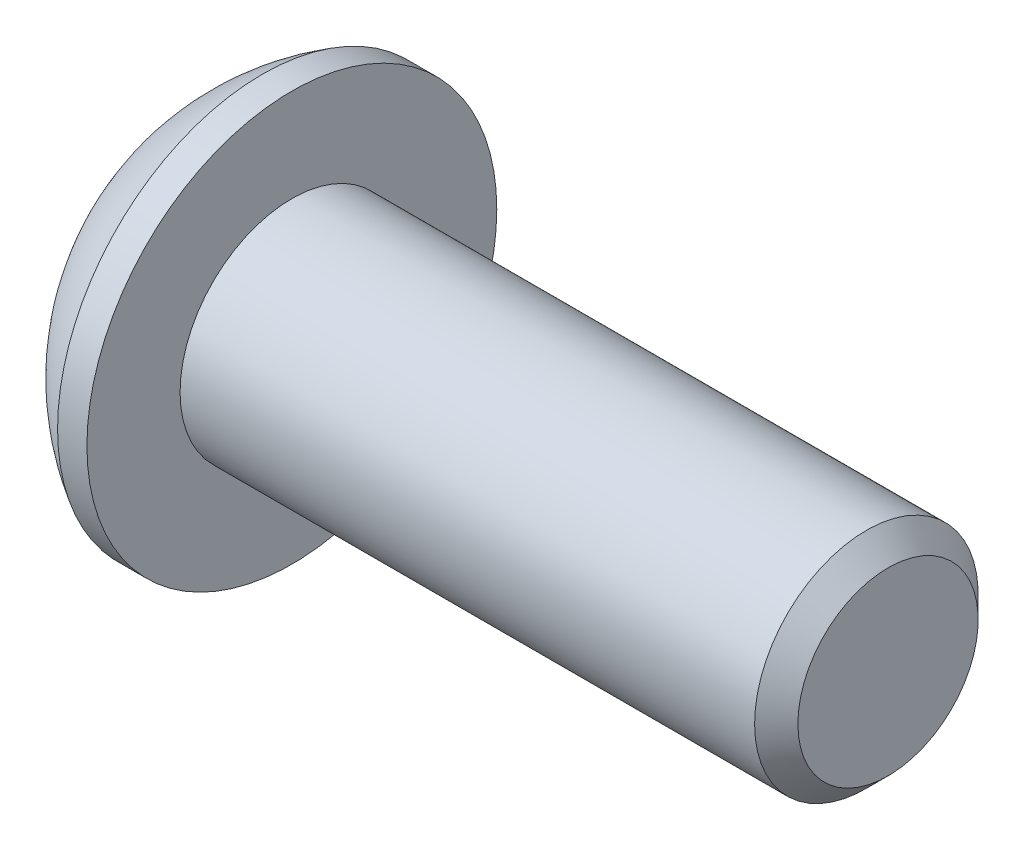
ISO-10303-21;
HEADER;
FILE_DESCRIPTION(('STEP AP214'),'2;1');
FILE_NAME('part.step','',(''),(''),'','','');
FILE_SCHEMA(('AUTOMOTIVE_DESIGN { 1 0 10303 214 1 1 1 1 }'));
ENDSEC;
DATA;
#1=APPLICATION_CONTEXT('core data for automotive mechanical design processes');
#2=APPLICATION_PROTOCOL_DEFINITION('international standard','automotive_design',2000,#1);
#3=PRODUCT_CONTEXT('',#1,'mechanical');
#4=PRODUCT('Part','Part','',(#3));
#5=PRODUCT_RELATED_PRODUCT_CATEGORY('part','',(#4));
#6=PRODUCT_DEFINITION_FORMATION('','',#4);
#7=PRODUCT_DEFINITION_CONTEXT('part definition',#1,'design');
#8=PRODUCT_DEFINITION('design','',#6,#7);
#9=PRODUCT_DEFINITION_SHAPE('','',#8);
#10=(LENGTH_UNIT() NAMED_UNIT(*) SI_UNIT(.MILLI.,.METRE.));
#11=(NAMED_UNIT(*) PLANE_ANGLE_UNIT() SI_UNIT($,.RADIAN.));
#12=(NAMED_UNIT(*) SI_UNIT($,.STERADIAN.) SOLID_ANGLE_UNIT());
#13=UNCERTAINTY_MEASURE_WITH_UNIT(LENGTH_MEASURE(1.E-05),#10,'distance_accuracy_value','');
#14=(GEOMETRIC_REPRESENTATION_CONTEXT(3) GLOBAL_UNCERTAINTY_ASSIGNED_CONTEXT((#13)) GLOBAL_UNIT_ASSIGNED_CONTEXT((#10,
#11,#12)) REPRESENTATION_CONTEXT('',''));
#15=CARTESIAN_POINT('',(0.,0.,0.));
#16=DIRECTION('',(0.,0.,1.));
#17=DIRECTION('',(1.,0.,0.));
#18=AXIS2_PLACEMENT_3D('',#15,#16,#17);
#19=CARTESIAN_POINT('',(0.,0.,0.));
#20=DIRECTION('',(-1.,0.,0.));
#21=DIRECTION('',(0.,0.,1.));
#22=AXIS2_PLACEMENT_3D('',#19,#20,#21);
#23=PLANE('',#22);
#24=CARTESIAN_POINT('',(0.,0.,0.));
#25=DIRECTION('',(-1.,0.,0.));
#26=DIRECTION('',(0.,0.,1.));
#27=AXIS2_PLACEMENT_3D('',#24,#25,#26);
#28=CIRCLE('',#27,2.75);
#29=CARTESIAN_POINT('',(0.,2.75,0.));
#30=VERTEX_POINT('',#29);
#31=EDGE_CURVE('E11',#30,#30,#28,.T.);
#32=ORIENTED_EDGE('',*,*,#31,.T.);
#33=EDGE_LOOP('',(#32));
#34=FACE_BOUND('',#33,.T.);
#35=DIRECTION('',(0.,-1.,0.));
#36=VECTOR('',#35,1.);
#37=CARTESIAN_POINT('',(0.,-1.15470053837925,2.));
#38=LINE('',#37,#36);
#39=CARTESIAN_POINT('',(0.,1.15470053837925,2.));
#40=VERTEX_POINT('',#39);
#41=CARTESIAN_POINT('',(0.,-1.15470053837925,2.));
#42=VERTEX_POINT('',#41);
#43=EDGE_CURVE('E111',#40,#42,#38,.T.);
#44=ORIENTED_EDGE('',*,*,#43,.T.);
#45=DIRECTION('',(0.,-0.5,-0.866025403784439));
#46=VECTOR('',#45,1.);
#47=CARTESIAN_POINT('',(0.,-2.3094010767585,0.));
#48=LINE('',#47,#46);
#49=CARTESIAN_POINT('',(0.,-2.3094010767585,0.));
#50=VERTEX_POINT('',#49);
#51=EDGE_CURVE('E52',#42,#50,#48,.T.);
#52=ORIENTED_EDGE('',*,*,#51,.T.);
#53=DIRECTION('',(0.,0.5,-0.866025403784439));
#54=VECTOR('',#53,1.);
#55=CARTESIAN_POINT('',(0.,-1.15470053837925,-2.));
#56=LINE('',#55,#54);
#57=CARTESIAN_POINT('',(0.,-1.15470053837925,-2.));
#58=VERTEX_POINT('',#57);
#59=EDGE_CURVE('E92',#50,#58,#56,.T.);
#60=ORIENTED_EDGE('',*,*,#59,.T.);
#61=DIRECTION('',(0.,1.,0.));
#62=VECTOR('',#61,1.);
#63=CARTESIAN_POINT('',(0.,1.15470053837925,-2.));
#64=LINE('',#63,#62);
#65=CARTESIAN_POINT('',(0.,1.15470053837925,-2.));
#66=VERTEX_POINT('',#65);
#67=EDGE_CURVE('E100',#58,#66,#64,.T.);
#68=ORIENTED_EDGE('',*,*,#67,.T.);
#69=DIRECTION('',(0.,0.5,0.866025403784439));
#70=VECTOR('',#69,1.);
#71=CARTESIAN_POINT('',(0.,2.3094010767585,0.));
#72=LINE('',#71,#70);
#73=CARTESIAN_POINT('',(0.,2.3094010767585,0.));
#74=VERTEX_POINT('',#73);
#75=EDGE_CURVE('E115',#66,#74,#72,.T.);
#76=ORIENTED_EDGE('',*,*,#75,.T.);
#77=DIRECTION('',(0.,-0.5,0.866025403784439));
#78=VECTOR('',#77,1.);
#79=CARTESIAN_POINT('',(0.,1.15470053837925,2.));
#80=LINE('',#79,#78);
#81=EDGE_CURVE('E118',#74,#40,#80,.T.);
#82=ORIENTED_EDGE('',*,*,#81,.T.);
#83=EDGE_LOOP('',(#44,#52,#60,#68,#76,#82));
#84=FACE_BOUND('',#83,.T.);
#85=ADVANCED_FACE('F38',(#34,#84),#23,.T.);
#86=CARTESIAN_POINT('',(5.7045250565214,0.,0.));
#87=DIRECTION('',(-1.,0.,0.));
#88=DIRECTION('',(0.,1.,0.));
#89=AXIS2_PLACEMENT_3D('',#86,#87,#88);
#90=SPHERICAL_SURFACE('',#89,6.33278028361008);
#91=CARTESIAN_POINT('',(2.5654,0.,0.));
#92=DIRECTION('',(-1.,0.,0.));
#93=DIRECTION('',(0.,0.,1.));
#94=AXIS2_PLACEMENT_3D('',#91,#92,#93);
#95=CIRCLE('',#94,5.5);
#96=CARTESIAN_POINT('',(2.5654,5.5,0.));
#97=VERTEX_POINT('',#96);
#98=EDGE_CURVE('E45',#97,#97,#95,.T.);
#99=CARTESIAN_POINT('',(2.5654,5.5,0.));
#100=CARTESIAN_POINT('',(2.53085550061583,5.48028378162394,0.));
#101=CARTESIAN_POINT('',(2.4964968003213,5.46024203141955,0.));
#102=CARTESIAN_POINT('',(2.42816308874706,5.41951476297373,0.));
#103=CARTESIAN_POINT('',(2.39418807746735,5.3988292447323,0.));
#104=CARTESIAN_POINT('',(2.32663383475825,5.35682173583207,0.));
#105=CARTESIAN_POINT('',(2.29305460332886,5.33549974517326,0.));
#106=CARTESIAN_POINT('',(2.22630383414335,5.29222687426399,0.));
#107=CARTESIAN_POINT('',(2.19313229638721,5.27027599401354,0.));
#108=CARTESIAN_POINT('',(2.12720869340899,5.22575313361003,0.));
#109=CARTESIAN_POINT('',(2.09445662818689,5.20318115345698,0.));
#110=CARTESIAN_POINT('',(2.02938359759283,5.15742410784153,0.));
#111=CARTESIAN_POINT('',(1.99706263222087,5.13423904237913,0.));
#112=CARTESIAN_POINT('',(1.93286327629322,5.08726405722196,0.));
#113=CARTESIAN_POINT('',(1.90098488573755,5.0634741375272,0.));
#114=CARTESIAN_POINT('',(1.83768199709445,5.01529789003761,0.));
#115=CARTESIAN_POINT('',(1.80625749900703,4.99091156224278,0.));
#116=CARTESIAN_POINT('',(1.74387355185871,4.94155115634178,0.));
#117=CARTESIAN_POINT('',(1.71291410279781,4.91657707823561,0.));
#118=CARTESIAN_POINT('',(1.6514712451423,4.8660500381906,0.));
#119=CARTESIAN_POINT('',(1.62098783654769,4.84049707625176,0.));
#120=CARTESIAN_POINT('',(1.56050788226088,4.78882134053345,0.));
#121=CARTESIAN_POINT('',(1.53051133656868,4.76269856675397,0.));
#122=CARTESIAN_POINT('',(1.47101575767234,4.70989248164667,0.));
#123=CARTESIAN_POINT('',(1.4415167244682,4.68320917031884,0.));
#124=CARTESIAN_POINT('',(1.38302664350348,4.6292914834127,0.));
#125=CARTESIAN_POINT('',(1.35403559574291,4.60205710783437,0.));
#126=CARTESIAN_POINT('',(1.29657177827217,4.54704696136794,0.));
#127=CARTESIAN_POINT('',(1.268099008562,4.51927119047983,0.));
#128=CARTESIAN_POINT('',(1.21168185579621,4.46318811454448,0.));
#129=CARTESIAN_POINT('',(1.18373747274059,4.43488080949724,0.));
#130=CARTESIAN_POINT('',(1.12838701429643,4.37774471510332,0.));
#131=CARTESIAN_POINT('',(1.1009809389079,4.34891592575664,0.));
#132=CARTESIAN_POINT('',(1.04671682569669,4.29074709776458,0.));
#133=CARTESIAN_POINT('',(1.01985878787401,4.2614070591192,0.));
#134=CARTESIAN_POINT('',(0.966700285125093,4.20222614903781,0.));
#135=CARTESIAN_POINT('',(0.940399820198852,4.1723852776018,0.));
#136=CARTESIAN_POINT('',(0.888365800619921,4.11221329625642,0.));
#137=CARTESIAN_POINT('',(0.862632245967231,4.08188218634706,0.));
#138=CARTESIAN_POINT('',(0.811741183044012,4.02074049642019,0.));
#139=CARTESIAN_POINT('',(0.786583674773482,3.98992991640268,0.));
#140=CARTESIAN_POINT('',(0.736853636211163,3.92784022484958,0.));
#141=CARTESIAN_POINT('',(0.712281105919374,3.89656111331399,0.));
#142=CARTESIAN_POINT('',(0.663729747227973,3.83354546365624,0.));
#143=CARTESIAN_POINT('',(0.639750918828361,3.80180892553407,0.));
#144=CARTESIAN_POINT('',(0.592395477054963,3.73788969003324,0.));
#145=CARTESIAN_POINT('',(0.569018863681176,3.70570699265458,0.));
#146=CARTESIAN_POINT('',(0.522876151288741,3.64090686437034,0.));
#147=CARTESIAN_POINT('',(0.500110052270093,3.60828943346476,0.));
#148=CARTESIAN_POINT('',(0.455196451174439,3.54263141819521,0.));
#149=CARTESIAN_POINT('',(0.433048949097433,3.50959083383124,0.));
#150=CARTESIAN_POINT('',(0.389380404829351,3.44309824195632,0.));
#151=CARTESIAN_POINT('',(0.367859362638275,3.40964623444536,0.));
#152=CARTESIAN_POINT('',(0.325451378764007,3.34234267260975,0.));
#153=CARTESIAN_POINT('',(0.304564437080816,3.3084911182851,0.));
#154=CARTESIAN_POINT('',(0.263432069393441,3.24040048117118,0.));
#155=CARTESIAN_POINT('',(0.243186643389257,3.20616139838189,0.));
#156=CARTESIAN_POINT('',(0.203344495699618,3.13730785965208,0.));
#157=CARTESIAN_POINT('',(0.183747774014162,3.10269340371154,0.));
#158=CARTESIAN_POINT('',(0.145209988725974,3.03310140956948,0.));
#159=CARTESIAN_POINT('',(0.126268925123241,2.99812387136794,0.));
#160=CARTESIAN_POINT('',(0.0890491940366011,2.92781812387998,0.));
#161=CARTESIAN_POINT('',(0.0707705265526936,2.89248991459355,0.));
#162=CARTESIAN_POINT('',(0.0348820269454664,2.82149539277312,0.));
#163=CARTESIAN_POINT('',(0.0172721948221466,2.78582908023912,0.));
#164=CARTESIAN_POINT('',(0.,2.75,0.));
#165=B_SPLINE_CURVE_WITH_KNOTS('',3,(#99,#100,#101,#102,#103,#104,#105,#106,#107,#108,#109,#110,
#111,#112,#113,#114,#115,#116,#117,#118,#119,#120,#121,#122,#123,#124,#125,#126,#127,#128,#129,
#130,#131,#132,#133,#134,#135,#136,#137,#138,#139,#140,#141,#142,#143,#144,#145,#146,#147,#148,
#149,#150,#151,#152,#153,#154,#155,#156,#157,#158,#159,#160,#161,#162,#163,#164),.UNSPECIFIED.,
.F.,.F.,(4,2,2,2,2,2,2,2,2,2,2,2,2,2,2,2,2,2,2,2,2,2,2,2,2,2,2,2,2,2,2,2,4),(0.,
0.119323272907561,0.238646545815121,0.357969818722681,0.477293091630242,0.596616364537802,
0.715939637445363,0.835262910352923,0.954586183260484,1.07390945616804,1.1932327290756,
1.31255600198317,1.43187927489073,1.55120254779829,1.67052582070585,1.78984909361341,
1.90917236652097,2.02849563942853,2.14781891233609,2.26714218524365,2.38646545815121,
2.50578873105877,2.62511200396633,2.74443527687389,2.86375854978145,2.98308182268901,
3.10240509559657,3.22172836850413,3.34105164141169,3.46037491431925,3.57969818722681,
3.69902146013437,3.81834473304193),.UNSPECIFIED.);
#166=EDGE_CURVE('BSEAM157',#97,#30,#165,.T.);
#167=ORIENTED_EDGE('',*,*,#98,.T.);
#168=ORIENTED_EDGE('',*,*,#31,.F.);
#169=ORIENTED_EDGE('',*,*,#166,.T.);
#170=ORIENTED_EDGE('',*,*,#166,.F.);
#171=EDGE_LOOP('',(#167,#169,#168,#170));
#172=FACE_BOUND('',#171,.T.);
#173=ADVANCED_FACE('F157',(#172),#90,.T.);
#174=CARTESIAN_POINT('',(0.,0.,0.));
#175=DIRECTION('',(-1.,0.,0.));
#176=DIRECTION('',(0.,0.,1.));
#177=AXIS2_PLACEMENT_3D('',#174,#175,#176);
#178=CYLINDRICAL_SURFACE('',#177,5.5);
#179=ORIENTED_EDGE('',*,*,#98,.F.);
#180=EDGE_LOOP('',(#179));
#181=FACE_BOUND('',#180,.T.);
#182=CARTESIAN_POINT('',(3.3528,0.,0.));
#183=DIRECTION('',(-1.,0.,0.));
#184=DIRECTION('',(0.,0.,1.));
#185=AXIS2_PLACEMENT_3D('',#182,#183,#184);
#186=CIRCLE('',#185,5.5);
#187=CARTESIAN_POINT('',(3.3528,0.,5.5));
#188=VERTEX_POINT('',#187);
#189=EDGE_CURVE('E152',#188,#188,#186,.T.);
#190=ORIENTED_EDGE('',*,*,#189,.T.);
#191=EDGE_LOOP('',(#190));
#192=FACE_BOUND('',#191,.T.);
#193=ADVANCED_FACE('F160',(#181,#192),#178,.T.);
#194=CARTESIAN_POINT('',(3.3528,3.,0.));
#195=DIRECTION('',(-1.,0.,0.));
#196=DIRECTION('',(0.,0.,1.));
#197=AXIS2_PLACEMENT_3D('',#194,#195,#196);
#198=PLANE('',#197);
#199=ORIENTED_EDGE('',*,*,#189,.F.);
#200=EDGE_LOOP('',(#199));
#201=FACE_BOUND('',#200,.T.);
#202=CARTESIAN_POINT('',(3.3528,0.,0.));
#203=DIRECTION('',(-1.,0.,0.));
#204=DIRECTION('',(0.,0.,1.));
#205=AXIS2_PLACEMENT_3D('',#202,#203,#204);
#206=CIRCLE('',#205,3.);
#207=CARTESIAN_POINT('',(3.3528,0.,3.));
#208=VERTEX_POINT('',#207);
#209=EDGE_CURVE('E149',#208,#208,#206,.T.);
#210=ORIENTED_EDGE('',*,*,#209,.T.);
#211=EDGE_LOOP('',(#210));
#212=FACE_BOUND('',#211,.T.);
#213=ADVANCED_FACE('F163',(#201,#212),#198,.F.);
#214=CARTESIAN_POINT('',(0.,0.,0.));
#215=DIRECTION('',(-1.,0.,0.));
#216=DIRECTION('',(0.,0.,1.));
#217=AXIS2_PLACEMENT_3D('',#214,#215,#216);
#218=CYLINDRICAL_SURFACE('',#217,3.);
#219=ORIENTED_EDGE('',*,*,#209,.F.);
#220=EDGE_LOOP('',(#219));
#221=FACE_BOUND('',#220,.T.);
#222=CARTESIAN_POINT('',(18.77215,0.,0.));
#223=DIRECTION('',(-1.,0.,0.));
#224=DIRECTION('',(0.,0.,1.));
#225=AXIS2_PLACEMENT_3D('',#222,#223,#224);
#226=CIRCLE('',#225,3.);
#227=CARTESIAN_POINT('',(18.77215,0.,3.));
#228=VERTEX_POINT('',#227);
#229=EDGE_CURVE('E146',#228,#228,#226,.T.);
#230=ORIENTED_EDGE('',*,*,#229,.T.);
#231=EDGE_LOOP('',(#230));
#232=FACE_BOUND('',#231,.T.);
#233=ADVANCED_FACE('F169',(#221,#232),#218,.T.);
#234=CARTESIAN_POINT('',(19.3528,0.,0.));
#235=DIRECTION('',(-1.,0.,0.));
#236=DIRECTION('',(0.,0.,1.));
#237=AXIS2_PLACEMENT_3D('',#234,#235,#236);
#238=CONICAL_SURFACE('',#237,2.41935,0.785398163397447);
#239=ORIENTED_EDGE('',*,*,#229,.F.);
#240=EDGE_LOOP('',(#239));
#241=FACE_BOUND('',#240,.T.);
#242=CARTESIAN_POINT('',(19.3528,0.,0.));
#243=DIRECTION('',(-1.,0.,0.));
#244=DIRECTION('',(0.,0.,1.));
#245=AXIS2_PLACEMENT_3D('',#242,#243,#244);
#246=CIRCLE('',#245,2.41935);
#247=CARTESIAN_POINT('',(19.3528,0.,2.41935));
#248=VERTEX_POINT('',#247);
#249=EDGE_CURVE('E143',#248,#248,#246,.T.);
#250=ORIENTED_EDGE('',*,*,#249,.T.);
#251=EDGE_LOOP('',(#250));
#252=FACE_BOUND('',#251,.T.);
#253=ADVANCED_FACE('F175',(#241,#252),#238,.T.);
#254=CARTESIAN_POINT('',(19.3528,0.,0.));
#255=DIRECTION('',(-1.,0.,0.));
#256=DIRECTION('',(0.,0.,1.));
#257=AXIS2_PLACEMENT_3D('',#254,#255,#256);
#258=PLANE('',#257);
#259=ORIENTED_EDGE('',*,*,#249,.F.);
#260=EDGE_LOOP('',(#259));
#261=FACE_BOUND('',#260,.T.);
#262=ADVANCED_FACE('F181',(#261),#258,.F.);
#263=CARTESIAN_POINT('',(2.2098,-2.3094010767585,0.));
#264=DIRECTION('',(0.,0.866025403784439,-0.5));
#265=DIRECTION('',(0.,0.5,0.866025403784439));
#266=AXIS2_PLACEMENT_3D('',#263,#264,#265);
#267=PLANE('',#266);
#268=ORIENTED_EDGE('',*,*,#51,.F.);
#269=DIRECTION('',(-1.,0.,0.));
#270=VECTOR('',#269,1.);
#271=CARTESIAN_POINT('',(2.2098,-1.15470053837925,2.));
#272=LINE('',#271,#270);
#273=CARTESIAN_POINT('',(2.2098,-1.15470053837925,2.));
#274=VERTEX_POINT('',#273);
#275=EDGE_CURVE('E132',#274,#42,#272,.T.);
#276=ORIENTED_EDGE('',*,*,#275,.F.);
#277=DIRECTION('',(0.,-0.5,-0.866025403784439));
#278=VECTOR('',#277,1.);
#279=CARTESIAN_POINT('',(2.2098,-2.3094010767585,0.));
#280=LINE('',#279,#278);
#281=CARTESIAN_POINT('',(2.2098,-2.3094010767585,0.));
#282=VERTEX_POINT('',#281);
#283=EDGE_CURVE('E105',#274,#282,#280,.T.);
#284=ORIENTED_EDGE('',*,*,#283,.T.);
#285=DIRECTION('',(-1.,0.,0.));
#286=VECTOR('',#285,1.);
#287=CARTESIAN_POINT('',(2.2098,-2.3094010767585,0.));
#288=LINE('',#287,#286);
#289=EDGE_CURVE('E94',#282,#50,#288,.T.);
#290=ORIENTED_EDGE('',*,*,#289,.T.);
#291=EDGE_LOOP('',(#268,#276,#284,#290));
#292=FACE_BOUND('',#291,.T.);
#293=ADVANCED_FACE('F103',(#292),#267,.T.);
#294=CARTESIAN_POINT('',(2.2098,-1.15470053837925,-2.));
#295=DIRECTION('',(0.,0.866025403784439,0.5));
#296=DIRECTION('',(0.,-0.5,0.866025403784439));
#297=AXIS2_PLACEMENT_3D('',#294,#295,#296);
#298=PLANE('',#297);
#299=ORIENTED_EDGE('',*,*,#59,.F.);
#300=ORIENTED_EDGE('',*,*,#289,.F.);
#301=DIRECTION('',(0.,0.5,-0.866025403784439));
#302=VECTOR('',#301,1.);
#303=CARTESIAN_POINT('',(2.2098,-1.15470053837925,-2.));
#304=LINE('',#303,#302);
#305=CARTESIAN_POINT('',(2.2098,-1.15470053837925,-2.));
#306=VERTEX_POINT('',#305);
#307=EDGE_CURVE('E122',#282,#306,#304,.T.);
#308=ORIENTED_EDGE('',*,*,#307,.T.);
#309=DIRECTION('',(-1.,0.,0.));
#310=VECTOR('',#309,1.);
#311=CARTESIAN_POINT('',(2.2098,-1.15470053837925,-2.));
#312=LINE('',#311,#310);
#313=EDGE_CURVE('E96',#306,#58,#312,.T.);
#314=ORIENTED_EDGE('',*,*,#313,.T.);
#315=EDGE_LOOP('',(#299,#300,#308,#314));
#316=FACE_BOUND('',#315,.T.);
#317=ADVANCED_FACE('F93',(#316),#298,.T.);
#318=CARTESIAN_POINT('',(2.2098,1.15470053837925,-2.));
#319=DIRECTION('',(0.,0.,1.));
#320=DIRECTION('',(1.,0.,0.));
#321=AXIS2_PLACEMENT_3D('',#318,#319,#320);
#322=PLANE('',#321);
#323=ORIENTED_EDGE('',*,*,#67,.F.);
#324=ORIENTED_EDGE('',*,*,#313,.F.);
#325=DIRECTION('',(0.,1.,0.));
#326=VECTOR('',#325,1.);
#327=CARTESIAN_POINT('',(2.2098,1.15470053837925,-2.));
#328=LINE('',#327,#326);
#329=CARTESIAN_POINT('',(2.2098,1.15470053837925,-2.));
#330=VERTEX_POINT('',#329);
#331=EDGE_CURVE('E124',#306,#330,#328,.T.);
#332=ORIENTED_EDGE('',*,*,#331,.T.);
#333=DIRECTION('',(-1.,0.,0.));
#334=VECTOR('',#333,1.);
#335=CARTESIAN_POINT('',(2.2098,1.15470053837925,-2.));
#336=LINE('',#335,#334);
#337=EDGE_CURVE('E138',#330,#66,#336,.T.);
#338=ORIENTED_EDGE('',*,*,#337,.T.);
#339=EDGE_LOOP('',(#323,#324,#332,#338));
#340=FACE_BOUND('',#339,.T.);
#341=ADVANCED_FACE('F237',(#340),#322,.T.);
#342=CARTESIAN_POINT('',(2.2098,2.3094010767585,0.));
#343=DIRECTION('',(0.,-0.866025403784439,0.5));
#344=DIRECTION('',(0.,-0.5,-0.866025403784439));
#345=AXIS2_PLACEMENT_3D('',#342,#343,#344);
#346=PLANE('',#345);
#347=ORIENTED_EDGE('',*,*,#75,.F.);
#348=ORIENTED_EDGE('',*,*,#337,.F.);
#349=DIRECTION('',(0.,0.5,0.866025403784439));
#350=VECTOR('',#349,1.);
#351=CARTESIAN_POINT('',(2.2098,2.3094010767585,0.));
#352=LINE('',#351,#350);
#353=CARTESIAN_POINT('',(2.2098,2.3094010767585,0.));
#354=VERTEX_POINT('',#353);
#355=EDGE_CURVE('E126',#330,#354,#352,.T.);
#356=ORIENTED_EDGE('',*,*,#355,.T.);
#357=DIRECTION('',(-1.,0.,0.));
#358=VECTOR('',#357,1.);
#359=CARTESIAN_POINT('',(2.2098,2.3094010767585,0.));
#360=LINE('',#359,#358);
#361=EDGE_CURVE('E136',#354,#74,#360,.T.);
#362=ORIENTED_EDGE('',*,*,#361,.T.);
#363=EDGE_LOOP('',(#347,#348,#356,#362));
#364=FACE_BOUND('',#363,.T.);
#365=ADVANCED_FACE('F246',(#364),#346,.T.);
#366=CARTESIAN_POINT('',(2.2098,1.15470053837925,2.));
#367=DIRECTION('',(0.,-0.866025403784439,-0.5));
#368=DIRECTION('',(0.,0.5,-0.866025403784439));
#369=AXIS2_PLACEMENT_3D('',#366,#367,#368);
#370=PLANE('',#369);
#371=ORIENTED_EDGE('',*,*,#81,.F.);
#372=ORIENTED_EDGE('',*,*,#361,.F.);
#373=DIRECTION('',(0.,-0.5,0.866025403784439));
#374=VECTOR('',#373,1.);
#375=CARTESIAN_POINT('',(2.2098,1.15470053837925,2.));
#376=LINE('',#375,#374);
#377=CARTESIAN_POINT('',(2.2098,1.15470053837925,2.));
#378=VERTEX_POINT('',#377);
#379=EDGE_CURVE('E128',#354,#378,#376,.T.);
#380=ORIENTED_EDGE('',*,*,#379,.T.);
#381=DIRECTION('',(-1.,0.,0.));
#382=VECTOR('',#381,1.);
#383=CARTESIAN_POINT('',(2.2098,1.15470053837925,2.));
#384=LINE('',#383,#382);
#385=EDGE_CURVE('E134',#378,#40,#384,.T.);
#386=ORIENTED_EDGE('',*,*,#385,.T.);
#387=EDGE_LOOP('',(#371,#372,#380,#386));
#388=FACE_BOUND('',#387,.T.);
#389=ADVANCED_FACE('F256',(#388),#370,.T.);
#390=CARTESIAN_POINT('',(2.2098,-1.15470053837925,2.));
#391=DIRECTION('',(0.,0.,-1.));
#392=DIRECTION('',(-1.,0.,0.));
#393=AXIS2_PLACEMENT_3D('',#390,#391,#392);
#394=PLANE('',#393);
#395=ORIENTED_EDGE('',*,*,#43,.F.);
#396=ORIENTED_EDGE('',*,*,#385,.F.);
#397=DIRECTION('',(0.,-1.,0.));
#398=VECTOR('',#397,1.);
#399=CARTESIAN_POINT('',(2.2098,-1.15470053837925,2.));
#400=LINE('',#399,#398);
#401=EDGE_CURVE('E130',#378,#274,#400,.T.);
#402=ORIENTED_EDGE('',*,*,#401,.T.);
#403=ORIENTED_EDGE('',*,*,#275,.T.);
#404=EDGE_LOOP('',(#395,#396,#402,#403));
#405=FACE_BOUND('',#404,.T.);
#406=ADVANCED_FACE('F266',(#405),#394,.T.);
#407=CARTESIAN_POINT('',(2.2098,-1.15470053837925,2.));
#408=DIRECTION('',(-1.,0.,0.));
#409=DIRECTION('',(0.,0.,1.));
#410=AXIS2_PLACEMENT_3D('',#407,#408,#409);
#411=PLANE('',#410);
#412=CARTESIAN_POINT('',(2.2098,0.,0.));
#413=DIRECTION('',(-1.,0.,0.));
#414=DIRECTION('',(0.,0.,1.));
#415=AXIS2_PLACEMENT_3D('',#412,#413,#414);
#416=CIRCLE('',#415,1.9812);
#417=CARTESIAN_POINT('',(2.2098,0.,1.9812));
#418=VERTEX_POINT('',#417);
#419=EDGE_CURVE('E106',#418,#418,#416,.T.);
#420=ORIENTED_EDGE('',*,*,#419,.F.);
#421=EDGE_LOOP('',(#420));
#422=FACE_BOUND('',#421,.T.);
#423=ORIENTED_EDGE('',*,*,#283,.F.);
#424=ORIENTED_EDGE('',*,*,#401,.F.);
#425=ORIENTED_EDGE('',*,*,#379,.F.);
#426=ORIENTED_EDGE('',*,*,#355,.F.);
#427=ORIENTED_EDGE('',*,*,#331,.F.);
#428=ORIENTED_EDGE('',*,*,#307,.F.);
#429=EDGE_LOOP('',(#423,#424,#425,#426,#427,#428));
#430=FACE_BOUND('',#429,.T.);
#431=ADVANCED_FACE('F276',(#422,#430),#411,.T.);
#432=CARTESIAN_POINT('',(3.3536463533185,0.,0.));
#433=DIRECTION('',(-1.,0.,0.));
#434=DIRECTION('',(0.,0.,1.));
#435=AXIS2_PLACEMENT_3D('',#432,#433,#434);
#436=CONICAL_SURFACE('',#435,0.,1.04719755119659);
#437=ORIENTED_EDGE('',*,*,#419,.T.);
#438=EDGE_LOOP('',(#437));
#439=FACE_BOUND('',#438,.T.);
#440=CARTESIAN_POINT('',(3.3536463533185,0.,0.));
#441=VERTEX_POINT('',#440);
#442=VERTEX_LOOP('',#441);
#443=FACE_BOUND('',#442,.T.);
#444=ADVANCED_FACE('F286',(#439,#443),#436,.F.);
#445=CLOSED_SHELL('',(#85,#173,#193,#213,#233,#253,#262,#293,#317,#341,#365,#389,#406,#431,#444));
#446=MANIFOLD_SOLID_BREP('B2',#445);
#447=ADVANCED_BREP_SHAPE_REPRESENTATION('',(#18,#446),#14);
#448=SHAPE_DEFINITION_REPRESENTATION(#9,#447);
ENDSEC;
END-ISO-10303-21;
